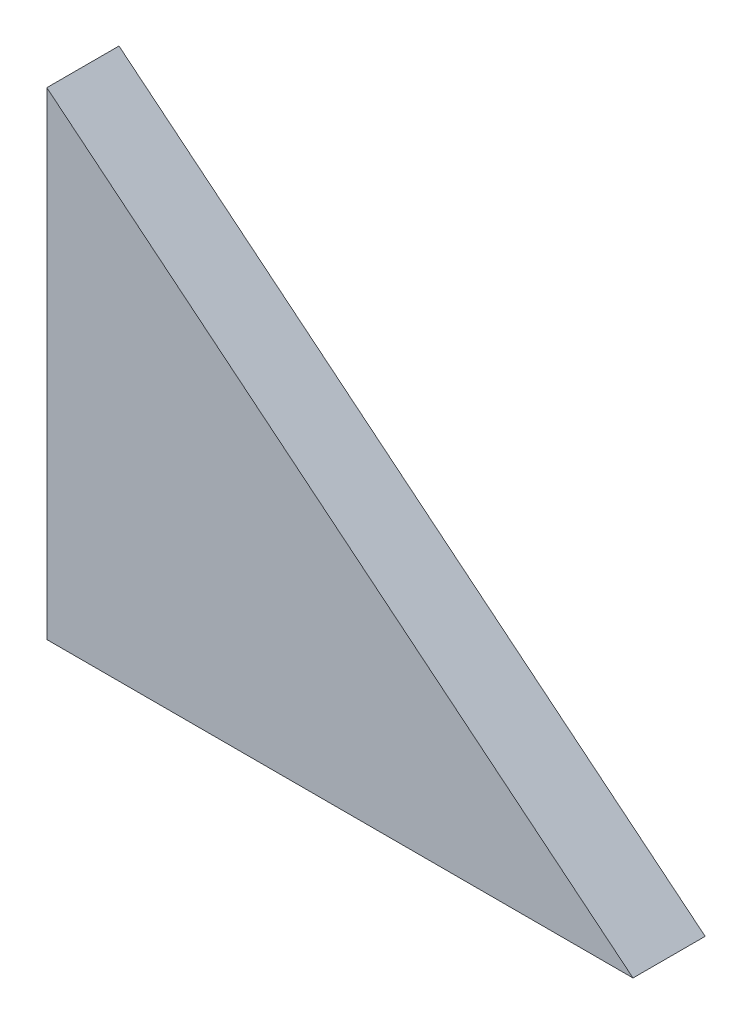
ISO-10303-21;
HEADER;
FILE_DESCRIPTION(('STEP AP214'),'2;1');
FILE_NAME('part.step','',(''),(''),'','','');
FILE_SCHEMA(('AUTOMOTIVE_DESIGN { 1 0 10303 214 1 1 1 1 }'));
ENDSEC;
DATA;
#1=APPLICATION_CONTEXT('core data for automotive mechanical design processes');
#2=APPLICATION_PROTOCOL_DEFINITION('international standard','automotive_design',2000,#1);
#3=PRODUCT_CONTEXT('',#1,'mechanical');
#4=PRODUCT('Part','Part','',(#3));
#5=PRODUCT_RELATED_PRODUCT_CATEGORY('part','',(#4));
#6=PRODUCT_DEFINITION_FORMATION('','',#4);
#7=PRODUCT_DEFINITION_CONTEXT('part definition',#1,'design');
#8=PRODUCT_DEFINITION('design','',#6,#7);
#9=PRODUCT_DEFINITION_SHAPE('','',#8);
#10=(LENGTH_UNIT() NAMED_UNIT(*) SI_UNIT(.MILLI.,.METRE.));
#11=(NAMED_UNIT(*) PLANE_ANGLE_UNIT() SI_UNIT($,.RADIAN.));
#12=(NAMED_UNIT(*) SI_UNIT($,.STERADIAN.) SOLID_ANGLE_UNIT());
#13=UNCERTAINTY_MEASURE_WITH_UNIT(LENGTH_MEASURE(1.E-05),#10,'distance_accuracy_value','');
#14=(GEOMETRIC_REPRESENTATION_CONTEXT(3) GLOBAL_UNCERTAINTY_ASSIGNED_CONTEXT((#13)) GLOBAL_UNIT_ASSIGNED_CONTEXT((#10,
#11,#12)) REPRESENTATION_CONTEXT('',''));
#15=CARTESIAN_POINT('',(0.,0.,0.));
#16=DIRECTION('',(0.,0.,1.));
#17=DIRECTION('',(1.,0.,0.));
#18=AXIS2_PLACEMENT_3D('',#15,#16,#17);
#19=CARTESIAN_POINT('',(65.,0.,8.));
#20=DIRECTION('',(0.,1.,0.));
#21=DIRECTION('',(-1.,0.,0.));
#22=AXIS2_PLACEMENT_3D('',#19,#20,#21);
#23=PLANE('',#22);
#24=DIRECTION('',(1.,0.,0.));
#25=VECTOR('',#24,1.);
#26=CARTESIAN_POINT('',(65.,0.,0.));
#27=LINE('',#26,#25);
#28=CARTESIAN_POINT('',(0.,0.,0.));
#29=VERTEX_POINT('',#28);
#30=CARTESIAN_POINT('',(65.,0.,0.));
#31=VERTEX_POINT('',#30);
#32=EDGE_CURVE('E78',#29,#31,#27,.T.);
#33=ORIENTED_EDGE('',*,*,#32,.T.);
#34=DIRECTION('',(0.,0.,-1.));
#35=VECTOR('',#34,1.);
#36=CARTESIAN_POINT('',(65.,0.,8.));
#37=LINE('',#36,#35);
#38=CARTESIAN_POINT('',(65.,0.,8.));
#39=VERTEX_POINT('',#38);
#40=EDGE_CURVE('E11',#39,#31,#37,.T.);
#41=ORIENTED_EDGE('',*,*,#40,.F.);
#42=DIRECTION('',(1.,0.,0.));
#43=VECTOR('',#42,1.);
#44=CARTESIAN_POINT('',(65.,0.,8.));
#45=LINE('',#44,#43);
#46=CARTESIAN_POINT('',(0.,0.,8.));
#47=VERTEX_POINT('',#46);
#48=EDGE_CURVE('E71',#47,#39,#45,.T.);
#49=ORIENTED_EDGE('',*,*,#48,.F.);
#50=DIRECTION('',(0.,0.,-1.));
#51=VECTOR('',#50,1.);
#52=CARTESIAN_POINT('',(0.,0.,8.));
#53=LINE('',#52,#51);
#54=EDGE_CURVE('E79',#47,#29,#53,.T.);
#55=ORIENTED_EDGE('',*,*,#54,.T.);
#56=EDGE_LOOP('',(#33,#41,#49,#55));
#57=FACE_BOUND('',#56,.T.);
#58=ADVANCED_FACE('F31',(#57),#23,.F.);
#59=CARTESIAN_POINT('',(0.,53.,8.));
#60=DIRECTION('',(-0.63193831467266,-0.775018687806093,0.));
#61=DIRECTION('',(0.775018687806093,-0.63193831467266,0.));
#62=AXIS2_PLACEMENT_3D('',#59,#60,#61);
#63=PLANE('',#62);
#64=DIRECTION('',(-0.775018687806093,0.63193831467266,0.));
#65=VECTOR('',#64,1.);
#66=CARTESIAN_POINT('',(0.,53.,0.));
#67=LINE('',#66,#65);
#68=CARTESIAN_POINT('',(0.,53.,0.));
#69=VERTEX_POINT('',#68);
#70=EDGE_CURVE('E59',#31,#69,#67,.T.);
#71=ORIENTED_EDGE('',*,*,#70,.T.);
#72=DIRECTION('',(0.,0.,-1.));
#73=VECTOR('',#72,1.);
#74=CARTESIAN_POINT('',(0.,53.,8.));
#75=LINE('',#74,#73);
#76=CARTESIAN_POINT('',(0.,53.,8.));
#77=VERTEX_POINT('',#76);
#78=EDGE_CURVE('E39',#77,#69,#75,.T.);
#79=ORIENTED_EDGE('',*,*,#78,.F.);
#80=DIRECTION('',(-0.775018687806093,0.63193831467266,0.));
#81=VECTOR('',#80,1.);
#82=CARTESIAN_POINT('',(0.,53.,8.));
#83=LINE('',#82,#81);
#84=EDGE_CURVE('E67',#39,#77,#83,.T.);
#85=ORIENTED_EDGE('',*,*,#84,.F.);
#86=ORIENTED_EDGE('',*,*,#40,.T.);
#87=EDGE_LOOP('',(#71,#79,#85,#86));
#88=FACE_BOUND('',#87,.T.);
#89=ADVANCED_FACE('F68',(#88),#63,.F.);
#90=CARTESIAN_POINT('',(0.,0.,8.));
#91=DIRECTION('',(1.,0.,0.));
#92=DIRECTION('',(0.,0.,-1.));
#93=AXIS2_PLACEMENT_3D('',#90,#91,#92);
#94=PLANE('',#93);
#95=DIRECTION('',(0.,-1.,0.));
#96=VECTOR('',#95,1.);
#97=CARTESIAN_POINT('',(0.,0.,0.));
#98=LINE('',#97,#96);
#99=EDGE_CURVE('E64',#69,#29,#98,.T.);
#100=ORIENTED_EDGE('',*,*,#99,.T.);
#101=ORIENTED_EDGE('',*,*,#54,.F.);
#102=DIRECTION('',(0.,-1.,0.));
#103=VECTOR('',#102,1.);
#104=CARTESIAN_POINT('',(0.,0.,8.));
#105=LINE('',#104,#103);
#106=EDGE_CURVE('E47',#77,#47,#105,.T.);
#107=ORIENTED_EDGE('',*,*,#106,.F.);
#108=ORIENTED_EDGE('',*,*,#78,.T.);
#109=EDGE_LOOP('',(#100,#101,#107,#108));
#110=FACE_BOUND('',#109,.T.);
#111=ADVANCED_FACE('F86',(#110),#94,.F.);
#112=CARTESIAN_POINT('',(0.,0.,8.));
#113=DIRECTION('',(0.,0.,-1.));
#114=DIRECTION('',(-1.,0.,0.));
#115=AXIS2_PLACEMENT_3D('',#112,#113,#114);
#116=PLANE('',#115);
#117=ORIENTED_EDGE('',*,*,#48,.T.);
#118=ORIENTED_EDGE('',*,*,#84,.T.);
#119=ORIENTED_EDGE('',*,*,#106,.T.);
#120=EDGE_LOOP('',(#117,#118,#119));
#121=FACE_BOUND('',#120,.T.);
#122=ADVANCED_FACE('F74',(#121),#116,.F.);
#123=CARTESIAN_POINT('',(0.,0.,0.));
#124=DIRECTION('',(0.,0.,-1.));
#125=DIRECTION('',(-1.,0.,0.));
#126=AXIS2_PLACEMENT_3D('',#123,#124,#125);
#127=PLANE('',#126);
#128=ORIENTED_EDGE('',*,*,#32,.F.);
#129=ORIENTED_EDGE('',*,*,#99,.F.);
#130=ORIENTED_EDGE('',*,*,#70,.F.);
#131=EDGE_LOOP('',(#128,#129,#130));
#132=FACE_BOUND('',#131,.T.);
#133=ADVANCED_FACE('F87',(#132),#127,.T.);
#134=CLOSED_SHELL('',(#58,#89,#111,#122,#133));
#135=MANIFOLD_SOLID_BREP('B2',#134);
#136=ADVANCED_BREP_SHAPE_REPRESENTATION('',(#18,#135),#14);
#137=SHAPE_DEFINITION_REPRESENTATION(#9,#136);
ENDSEC;
END-ISO-10303-21;
